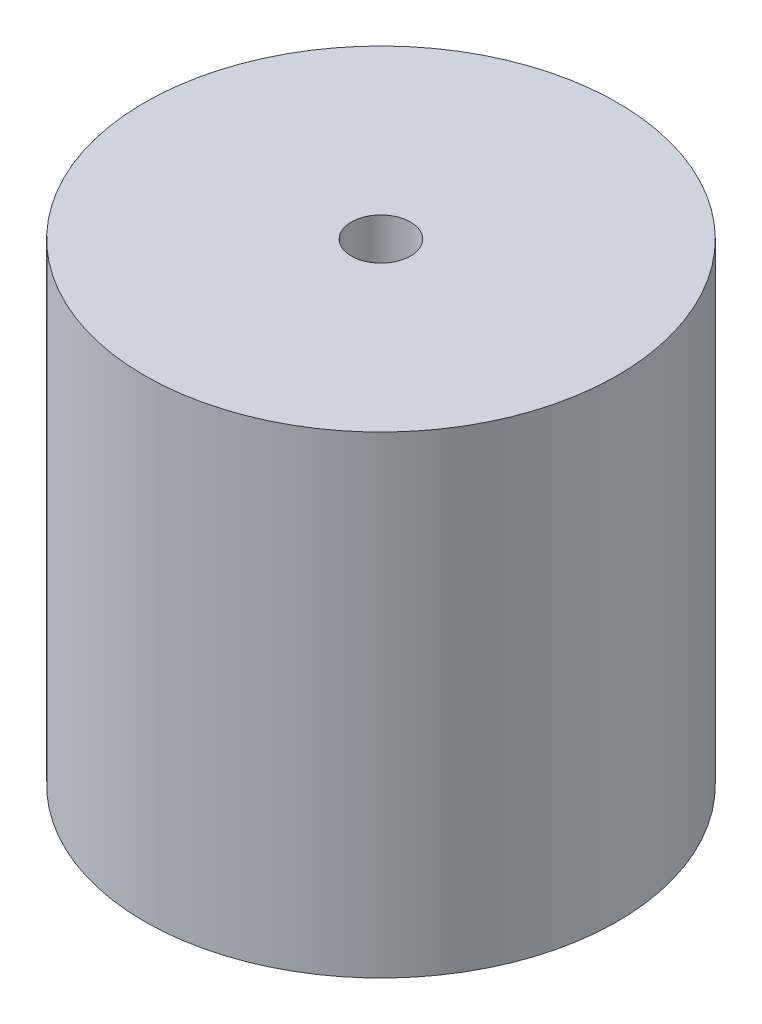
from build123d import *

# Parameters (mm, degrees)
SKETCH1_R                    = 12.7
EXTRUDE1_DEPTH               = 25.4
F_1_8_0_125_DIAMETER_HOLE1_D = 3.175


with BuildPart() as part:
    # Sketch1 → Extrude1 (new body)
    with BuildSketch(Plane(origin=(0, 0, 0), x_dir=(1, 0, 0), z_dir=(0, 1, 0))):
        with Locations(Location((0, 0, 0), (0, 0, 270))):
            Circle(SKETCH1_R)
    extrude(amount=EXTRUDE1_DEPTH)

    # 1_8 _0.125_ Diameter Hole1 (through all)
    with Locations(Plane.ZX.offset(25.4)):
        with Locations((0, 0)):
            Hole(F_1_8_0_125_DIAMETER_HOLE1_D / 2)


solid = part.part
